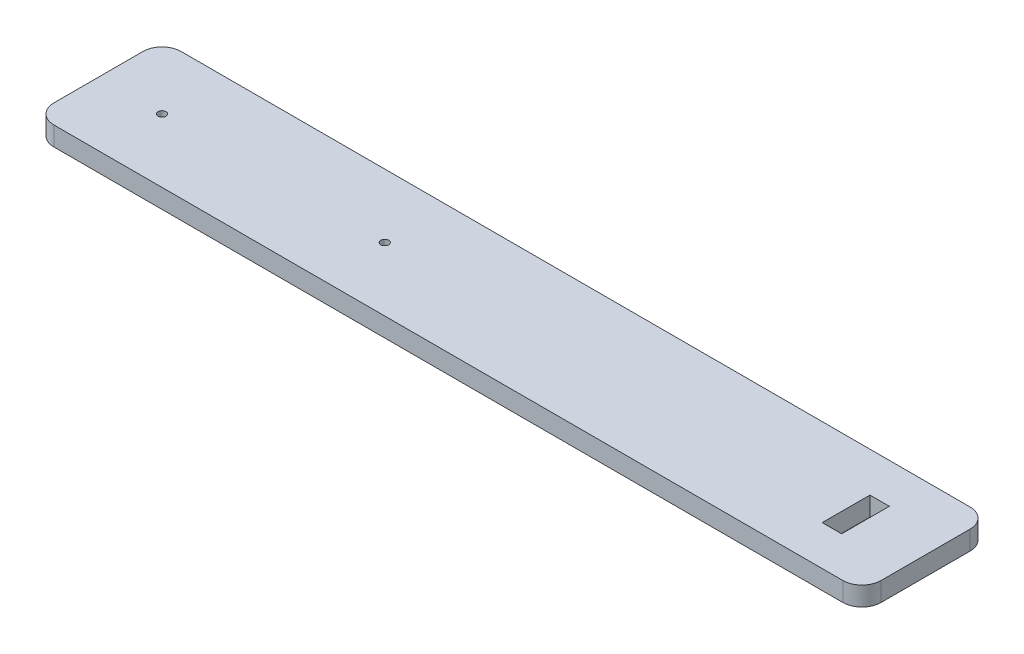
ISO-10303-21;
HEADER;
FILE_DESCRIPTION(('STEP AP214'),'2;1');
FILE_NAME('part.step','',(''),(''),'','','');
FILE_SCHEMA(('AUTOMOTIVE_DESIGN { 1 0 10303 214 1 1 1 1 }'));
ENDSEC;
DATA;
#1=APPLICATION_CONTEXT('core data for automotive mechanical design processes');
#2=APPLICATION_PROTOCOL_DEFINITION('international standard','automotive_design',2000,#1);
#3=PRODUCT_CONTEXT('',#1,'mechanical');
#4=PRODUCT('Part','Part','',(#3));
#5=PRODUCT_RELATED_PRODUCT_CATEGORY('part','',(#4));
#6=PRODUCT_DEFINITION_FORMATION('','',#4);
#7=PRODUCT_DEFINITION_CONTEXT('part definition',#1,'design');
#8=PRODUCT_DEFINITION('design','',#6,#7);
#9=PRODUCT_DEFINITION_SHAPE('','',#8);
#10=(LENGTH_UNIT() NAMED_UNIT(*) SI_UNIT(.MILLI.,.METRE.));
#11=(NAMED_UNIT(*) PLANE_ANGLE_UNIT() SI_UNIT($,.RADIAN.));
#12=(NAMED_UNIT(*) SI_UNIT($,.STERADIAN.) SOLID_ANGLE_UNIT());
#13=UNCERTAINTY_MEASURE_WITH_UNIT(LENGTH_MEASURE(1.E-05),#10,'distance_accuracy_value','');
#14=(GEOMETRIC_REPRESENTATION_CONTEXT(3) GLOBAL_UNCERTAINTY_ASSIGNED_CONTEXT((#13)) GLOBAL_UNIT_ASSIGNED_CONTEXT((#10,
#11,#12)) REPRESENTATION_CONTEXT('',''));
#15=CARTESIAN_POINT('',(0.,0.,0.));
#16=DIRECTION('',(0.,0.,1.));
#17=DIRECTION('',(1.,0.,0.));
#18=AXIS2_PLACEMENT_3D('',#15,#16,#17);
#19=CARTESIAN_POINT('',(0.,6.,0.));
#20=DIRECTION('',(0.,1.,0.));
#21=DIRECTION('',(0.,0.,1.));
#22=AXIS2_PLACEMENT_3D('',#19,#20,#21);
#23=PLANE('',#22);
#24=CARTESIAN_POINT('',(-110.,6.,0.));
#25=DIRECTION('',(0.,1.,0.));
#26=DIRECTION('',(0.,0.,1.));
#27=AXIS2_PLACEMENT_3D('',#24,#25,#26);
#28=CIRCLE('',#27,1.25);
#29=CARTESIAN_POINT('',(-110.,6.,1.25));
#30=VERTEX_POINT('',#29);
#31=EDGE_CURVE('E199',#30,#30,#28,.T.);
#32=ORIENTED_EDGE('',*,*,#31,.F.);
#33=EDGE_LOOP('',(#32));
#34=FACE_BOUND('',#33,.T.);
#35=DIRECTION('',(0.,0.,1.));
#36=VECTOR('',#35,1.);
#37=CARTESIAN_POINT('',(-130.,6.,-20.));
#38=LINE('',#37,#36);
#39=CARTESIAN_POINT('',(-130.,6.,-14.));
#40=VERTEX_POINT('',#39);
#41=CARTESIAN_POINT('',(-130.,6.,14.));
#42=VERTEX_POINT('',#41);
#43=EDGE_CURVE('E214',#40,#42,#38,.T.);
#44=ORIENTED_EDGE('',*,*,#43,.T.);
#45=CARTESIAN_POINT('',(-124.,6.,14.));
#46=DIRECTION('',(0.,1.,0.));
#47=DIRECTION('',(0.,0.,1.));
#48=AXIS2_PLACEMENT_3D('',#45,#46,#47);
#49=CIRCLE('',#48,6.);
#50=CARTESIAN_POINT('',(-124.,6.,20.));
#51=VERTEX_POINT('',#50);
#52=EDGE_CURVE('E269',#42,#51,#49,.T.);
#53=ORIENTED_EDGE('',*,*,#52,.T.);
#54=DIRECTION('',(1.,0.,0.));
#55=VECTOR('',#54,1.);
#56=CARTESIAN_POINT('',(-130.,6.,20.));
#57=LINE('',#56,#55);
#58=CARTESIAN_POINT('',(124.,6.,20.));
#59=VERTEX_POINT('',#58);
#60=EDGE_CURVE('E218',#51,#59,#57,.T.);
#61=ORIENTED_EDGE('',*,*,#60,.T.);
#62=CARTESIAN_POINT('',(124.,6.,14.));
#63=DIRECTION('',(0.,1.,0.));
#64=DIRECTION('',(0.,0.,1.));
#65=AXIS2_PLACEMENT_3D('',#62,#63,#64);
#66=CIRCLE('',#65,6.);
#67=CARTESIAN_POINT('',(130.,6.,14.));
#68=VERTEX_POINT('',#67);
#69=EDGE_CURVE('E263',#59,#68,#66,.T.);
#70=ORIENTED_EDGE('',*,*,#69,.T.);
#71=DIRECTION('',(0.,0.,-1.));
#72=VECTOR('',#71,1.);
#73=CARTESIAN_POINT('',(130.,6.,-20.));
#74=LINE('',#73,#72);
#75=CARTESIAN_POINT('',(130.,6.,-14.));
#76=VERTEX_POINT('',#75);
#77=EDGE_CURVE('E207',#68,#76,#74,.T.);
#78=ORIENTED_EDGE('',*,*,#77,.T.);
#79=CARTESIAN_POINT('',(124.,6.,-14.));
#80=DIRECTION('',(0.,1.,0.));
#81=DIRECTION('',(0.,0.,1.));
#82=AXIS2_PLACEMENT_3D('',#79,#80,#81);
#83=CIRCLE('',#82,6.);
#84=CARTESIAN_POINT('',(124.,6.,-20.));
#85=VERTEX_POINT('',#84);
#86=EDGE_CURVE('E68',#76,#85,#83,.T.);
#87=ORIENTED_EDGE('',*,*,#86,.T.);
#88=DIRECTION('',(-1.,0.,0.));
#89=VECTOR('',#88,1.);
#90=CARTESIAN_POINT('',(-130.,6.,-20.));
#91=LINE('',#90,#89);
#92=CARTESIAN_POINT('',(-124.,6.,-20.));
#93=VERTEX_POINT('',#92);
#94=EDGE_CURVE('E210',#85,#93,#91,.T.);
#95=ORIENTED_EDGE('',*,*,#94,.T.);
#96=CARTESIAN_POINT('',(-124.,6.,-14.));
#97=DIRECTION('',(0.,1.,0.));
#98=DIRECTION('',(0.,0.,1.));
#99=AXIS2_PLACEMENT_3D('',#96,#97,#98);
#100=CIRCLE('',#99,6.);
#101=EDGE_CURVE('E266',#93,#40,#100,.T.);
#102=ORIENTED_EDGE('',*,*,#101,.T.);
#103=EDGE_LOOP('',(#44,#53,#61,#70,#78,#87,#95,#102));
#104=FACE_BOUND('',#103,.T.);
#105=CARTESIAN_POINT('',(-40.,6.,0.));
#106=DIRECTION('',(0.,1.,0.));
#107=DIRECTION('',(0.,0.,1.));
#108=AXIS2_PLACEMENT_3D('',#105,#106,#107);
#109=CIRCLE('',#108,1.25);
#110=CARTESIAN_POINT('',(-40.,6.,1.25));
#111=VERTEX_POINT('',#110);
#112=EDGE_CURVE('E191',#111,#111,#109,.T.);
#113=ORIENTED_EDGE('',*,*,#112,.F.);
#114=EDGE_LOOP('',(#113));
#115=FACE_BOUND('',#114,.T.);
#116=DIRECTION('',(-1.,0.,0.));
#117=VECTOR('',#116,1.);
#118=CARTESIAN_POINT('',(105.,6.,-7.5));
#119=LINE('',#118,#117);
#120=CARTESIAN_POINT('',(111.1,6.,-7.5));
#121=VERTEX_POINT('',#120);
#122=CARTESIAN_POINT('',(105.,6.,-7.5));
#123=VERTEX_POINT('',#122);
#124=EDGE_CURVE('E149',#121,#123,#119,.T.);
#125=ORIENTED_EDGE('',*,*,#124,.F.);
#126=DIRECTION('',(0.,0.,-1.));
#127=VECTOR('',#126,1.);
#128=CARTESIAN_POINT('',(111.1,6.,-7.5));
#129=LINE('',#128,#127);
#130=CARTESIAN_POINT('',(111.1,6.,7.5));
#131=VERTEX_POINT('',#130);
#132=EDGE_CURVE('E138',#131,#121,#129,.T.);
#133=ORIENTED_EDGE('',*,*,#132,.F.);
#134=DIRECTION('',(1.,0.,0.));
#135=VECTOR('',#134,1.);
#136=CARTESIAN_POINT('',(105.,6.,7.5));
#137=LINE('',#136,#135);
#138=CARTESIAN_POINT('',(105.,6.,7.5));
#139=VERTEX_POINT('',#138);
#140=EDGE_CURVE('E167',#139,#131,#137,.T.);
#141=ORIENTED_EDGE('',*,*,#140,.F.);
#142=DIRECTION('',(0.,0.,1.));
#143=VECTOR('',#142,1.);
#144=CARTESIAN_POINT('',(105.,6.,-7.5));
#145=LINE('',#144,#143);
#146=EDGE_CURVE('E163',#123,#139,#145,.T.);
#147=ORIENTED_EDGE('',*,*,#146,.F.);
#148=EDGE_LOOP('',(#125,#133,#141,#147));
#149=FACE_BOUND('',#148,.T.);
#150=ADVANCED_FACE('F45',(#34,#104,#115,#149),#23,.T.);
#151=CARTESIAN_POINT('',(0.,0.,0.));
#152=DIRECTION('',(0.,1.,0.));
#153=DIRECTION('',(0.,0.,1.));
#154=AXIS2_PLACEMENT_3D('',#151,#152,#153);
#155=PLANE('',#154);
#156=CARTESIAN_POINT('',(-40.,0.,0.));
#157=DIRECTION('',(0.,1.,0.));
#158=DIRECTION('',(0.,0.,1.));
#159=AXIS2_PLACEMENT_3D('',#156,#157,#158);
#160=CIRCLE('',#159,1.25);
#161=CARTESIAN_POINT('',(-40.,0.,1.25));
#162=VERTEX_POINT('',#161);
#163=EDGE_CURVE('E158',#162,#162,#160,.T.);
#164=ORIENTED_EDGE('',*,*,#163,.T.);
#165=EDGE_LOOP('',(#164));
#166=FACE_BOUND('',#165,.T.);
#167=CARTESIAN_POINT('',(-110.,0.,0.));
#168=DIRECTION('',(0.,1.,0.));
#169=DIRECTION('',(0.,0.,1.));
#170=AXIS2_PLACEMENT_3D('',#167,#168,#169);
#171=CIRCLE('',#170,1.25);
#172=CARTESIAN_POINT('',(-110.,0.,1.25));
#173=VERTEX_POINT('',#172);
#174=EDGE_CURVE('E195',#173,#173,#171,.T.);
#175=ORIENTED_EDGE('',*,*,#174,.T.);
#176=EDGE_LOOP('',(#175));
#177=FACE_BOUND('',#176,.T.);
#178=DIRECTION('',(1.,0.,0.));
#179=VECTOR('',#178,1.);
#180=CARTESIAN_POINT('',(-130.,0.,20.));
#181=LINE('',#180,#179);
#182=CARTESIAN_POINT('',(-124.,0.,20.));
#183=VERTEX_POINT('',#182);
#184=CARTESIAN_POINT('',(124.,0.,20.));
#185=VERTEX_POINT('',#184);
#186=EDGE_CURVE('E211',#183,#185,#181,.T.);
#187=ORIENTED_EDGE('',*,*,#186,.F.);
#188=CARTESIAN_POINT('',(-124.,0.,14.));
#189=DIRECTION('',(0.,1.,0.));
#190=DIRECTION('',(0.,0.,1.));
#191=AXIS2_PLACEMENT_3D('',#188,#189,#190);
#192=CIRCLE('',#191,6.);
#193=CARTESIAN_POINT('',(-130.,0.,14.));
#194=VERTEX_POINT('',#193);
#195=EDGE_CURVE('E251',#183,#194,#192,.F.);
#196=ORIENTED_EDGE('',*,*,#195,.T.);
#197=DIRECTION('',(0.,0.,1.));
#198=VECTOR('',#197,1.);
#199=CARTESIAN_POINT('',(-130.,0.,-20.));
#200=LINE('',#199,#198);
#201=CARTESIAN_POINT('',(-130.,0.,-14.));
#202=VERTEX_POINT('',#201);
#203=EDGE_CURVE('E229',#202,#194,#200,.T.);
#204=ORIENTED_EDGE('',*,*,#203,.F.);
#205=CARTESIAN_POINT('',(-124.,0.,-14.));
#206=DIRECTION('',(0.,1.,0.));
#207=DIRECTION('',(0.,0.,1.));
#208=AXIS2_PLACEMENT_3D('',#205,#206,#207);
#209=CIRCLE('',#208,6.);
#210=CARTESIAN_POINT('',(-124.,0.,-20.));
#211=VERTEX_POINT('',#210);
#212=EDGE_CURVE('E248',#202,#211,#209,.F.);
#213=ORIENTED_EDGE('',*,*,#212,.T.);
#214=DIRECTION('',(-1.,0.,0.));
#215=VECTOR('',#214,1.);
#216=CARTESIAN_POINT('',(-130.,0.,-20.));
#217=LINE('',#216,#215);
#218=CARTESIAN_POINT('',(124.,0.,-20.));
#219=VERTEX_POINT('',#218);
#220=EDGE_CURVE('E226',#219,#211,#217,.T.);
#221=ORIENTED_EDGE('',*,*,#220,.F.);
#222=CARTESIAN_POINT('',(124.,0.,-14.));
#223=DIRECTION('',(0.,1.,0.));
#224=DIRECTION('',(0.,0.,1.));
#225=AXIS2_PLACEMENT_3D('',#222,#223,#224);
#226=CIRCLE('',#225,6.);
#227=CARTESIAN_POINT('',(130.,0.,-14.));
#228=VERTEX_POINT('',#227);
#229=EDGE_CURVE('E242',#219,#228,#226,.F.);
#230=ORIENTED_EDGE('',*,*,#229,.T.);
#231=DIRECTION('',(0.,0.,-1.));
#232=VECTOR('',#231,1.);
#233=CARTESIAN_POINT('',(130.,0.,-20.));
#234=LINE('',#233,#232);
#235=CARTESIAN_POINT('',(130.,0.,14.));
#236=VERTEX_POINT('',#235);
#237=EDGE_CURVE('E203',#236,#228,#234,.T.);
#238=ORIENTED_EDGE('',*,*,#237,.F.);
#239=CARTESIAN_POINT('',(124.,0.,14.));
#240=DIRECTION('',(0.,1.,0.));
#241=DIRECTION('',(0.,0.,1.));
#242=AXIS2_PLACEMENT_3D('',#239,#240,#241);
#243=CIRCLE('',#242,6.);
#244=EDGE_CURVE('E245',#236,#185,#243,.F.);
#245=ORIENTED_EDGE('',*,*,#244,.T.);
#246=EDGE_LOOP('',(#187,#196,#204,#213,#221,#230,#238,#245));
#247=FACE_BOUND('',#246,.T.);
#248=DIRECTION('',(0.,0.,-1.));
#249=VECTOR('',#248,1.);
#250=CARTESIAN_POINT('',(111.1,0.,-7.5));
#251=LINE('',#250,#249);
#252=CARTESIAN_POINT('',(111.1,0.,7.5));
#253=VERTEX_POINT('',#252);
#254=CARTESIAN_POINT('',(111.1,0.,-7.5));
#255=VERTEX_POINT('',#254);
#256=EDGE_CURVE('E172',#253,#255,#251,.T.);
#257=ORIENTED_EDGE('',*,*,#256,.T.);
#258=DIRECTION('',(-1.,0.,0.));
#259=VECTOR('',#258,1.);
#260=CARTESIAN_POINT('',(105.,0.,-7.5));
#261=LINE('',#260,#259);
#262=CARTESIAN_POINT('',(105.,0.,-7.5));
#263=VERTEX_POINT('',#262);
#264=EDGE_CURVE('E156',#255,#263,#261,.T.);
#265=ORIENTED_EDGE('',*,*,#264,.T.);
#266=DIRECTION('',(0.,0.,1.));
#267=VECTOR('',#266,1.);
#268=CARTESIAN_POINT('',(105.,0.,-7.5));
#269=LINE('',#268,#267);
#270=CARTESIAN_POINT('',(105.,0.,7.5));
#271=VERTEX_POINT('',#270);
#272=EDGE_CURVE('E177',#263,#271,#269,.T.);
#273=ORIENTED_EDGE('',*,*,#272,.T.);
#274=DIRECTION('',(1.,0.,0.));
#275=VECTOR('',#274,1.);
#276=CARTESIAN_POINT('',(105.,0.,7.5));
#277=LINE('',#276,#275);
#278=EDGE_CURVE('E150',#271,#253,#277,.T.);
#279=ORIENTED_EDGE('',*,*,#278,.T.);
#280=EDGE_LOOP('',(#257,#265,#273,#279));
#281=FACE_BOUND('',#280,.T.);
#282=ADVANCED_FACE('F292',(#166,#177,#247,#281),#155,.F.);
#283=CARTESIAN_POINT('',(130.,6.,-20.));
#284=DIRECTION('',(-1.,0.,0.));
#285=DIRECTION('',(0.,0.,1.));
#286=AXIS2_PLACEMENT_3D('',#283,#284,#285);
#287=PLANE('',#286);
#288=ORIENTED_EDGE('',*,*,#77,.F.);
#289=DIRECTION('',(0.,-1.,0.));
#290=VECTOR('',#289,1.);
#291=CARTESIAN_POINT('',(130.,6.,14.));
#292=LINE('',#291,#290);
#293=EDGE_CURVE('E11',#68,#236,#292,.T.);
#294=ORIENTED_EDGE('',*,*,#293,.T.);
#295=ORIENTED_EDGE('',*,*,#237,.T.);
#296=DIRECTION('',(0.,-1.,0.));
#297=VECTOR('',#296,1.);
#298=CARTESIAN_POINT('',(130.,6.,-14.));
#299=LINE('',#298,#297);
#300=EDGE_CURVE('E54',#228,#76,#299,.F.);
#301=ORIENTED_EDGE('',*,*,#300,.T.);
#302=EDGE_LOOP('',(#288,#294,#295,#301));
#303=FACE_BOUND('',#302,.T.);
#304=ADVANCED_FACE('F281',(#303),#287,.F.);
#305=CARTESIAN_POINT('',(-130.,6.,-20.));
#306=DIRECTION('',(0.,0.,1.));
#307=DIRECTION('',(1.,0.,0.));
#308=AXIS2_PLACEMENT_3D('',#305,#306,#307);
#309=PLANE('',#308);
#310=ORIENTED_EDGE('',*,*,#220,.T.);
#311=DIRECTION('',(0.,-1.,0.));
#312=VECTOR('',#311,1.);
#313=CARTESIAN_POINT('',(-124.,6.,-20.));
#314=LINE('',#313,#312);
#315=EDGE_CURVE('E61',#211,#93,#314,.F.);
#316=ORIENTED_EDGE('',*,*,#315,.T.);
#317=ORIENTED_EDGE('',*,*,#94,.F.);
#318=DIRECTION('',(0.,-1.,0.));
#319=VECTOR('',#318,1.);
#320=CARTESIAN_POINT('',(124.,6.,-20.));
#321=LINE('',#320,#319);
#322=EDGE_CURVE('E272',#85,#219,#321,.T.);
#323=ORIENTED_EDGE('',*,*,#322,.T.);
#324=EDGE_LOOP('',(#310,#316,#317,#323));
#325=FACE_BOUND('',#324,.T.);
#326=ADVANCED_FACE('F289',(#325),#309,.F.);
#327=CARTESIAN_POINT('',(-130.,6.,-20.));
#328=DIRECTION('',(1.,0.,0.));
#329=DIRECTION('',(0.,0.,-1.));
#330=AXIS2_PLACEMENT_3D('',#327,#328,#329);
#331=PLANE('',#330);
#332=ORIENTED_EDGE('',*,*,#203,.T.);
#333=DIRECTION('',(0.,-1.,0.));
#334=VECTOR('',#333,1.);
#335=CARTESIAN_POINT('',(-130.,6.,14.));
#336=LINE('',#335,#334);
#337=EDGE_CURVE('E258',#194,#42,#336,.F.);
#338=ORIENTED_EDGE('',*,*,#337,.T.);
#339=ORIENTED_EDGE('',*,*,#43,.F.);
#340=DIRECTION('',(0.,-1.,0.));
#341=VECTOR('',#340,1.);
#342=CARTESIAN_POINT('',(-130.,6.,-14.));
#343=LINE('',#342,#341);
#344=EDGE_CURVE('E254',#40,#202,#343,.T.);
#345=ORIENTED_EDGE('',*,*,#344,.T.);
#346=EDGE_LOOP('',(#332,#338,#339,#345));
#347=FACE_BOUND('',#346,.T.);
#348=ADVANCED_FACE('F301',(#347),#331,.F.);
#349=CARTESIAN_POINT('',(-130.,6.,20.));
#350=DIRECTION('',(0.,0.,-1.));
#351=DIRECTION('',(-1.,0.,0.));
#352=AXIS2_PLACEMENT_3D('',#349,#350,#351);
#353=PLANE('',#352);
#354=ORIENTED_EDGE('',*,*,#60,.F.);
#355=DIRECTION('',(0.,-1.,0.));
#356=VECTOR('',#355,1.);
#357=CARTESIAN_POINT('',(-124.,6.,20.));
#358=LINE('',#357,#356);
#359=EDGE_CURVE('E238',#51,#183,#358,.T.);
#360=ORIENTED_EDGE('',*,*,#359,.T.);
#361=ORIENTED_EDGE('',*,*,#186,.T.);
#362=DIRECTION('',(0.,-1.,0.));
#363=VECTOR('',#362,1.);
#364=CARTESIAN_POINT('',(124.,6.,20.));
#365=LINE('',#364,#363);
#366=EDGE_CURVE('E222',#185,#59,#365,.F.);
#367=ORIENTED_EDGE('',*,*,#366,.T.);
#368=EDGE_LOOP('',(#354,#360,#361,#367));
#369=FACE_BOUND('',#368,.T.);
#370=ADVANCED_FACE('F309',(#369),#353,.F.);
#371=CARTESIAN_POINT('',(-110.,6.,0.));
#372=DIRECTION('',(0.,-1.,0.));
#373=DIRECTION('',(0.,0.,-1.));
#374=AXIS2_PLACEMENT_3D('',#371,#372,#373);
#375=CYLINDRICAL_SURFACE('',#374,1.25);
#376=ORIENTED_EDGE('',*,*,#31,.T.);
#377=EDGE_LOOP('',(#376));
#378=FACE_BOUND('',#377,.T.);
#379=ORIENTED_EDGE('',*,*,#174,.F.);
#380=EDGE_LOOP('',(#379));
#381=FACE_BOUND('',#380,.T.);
#382=ADVANCED_FACE('F330',(#378,#381),#375,.F.);
#383=CARTESIAN_POINT('',(-40.,6.,0.));
#384=DIRECTION('',(0.,-1.,0.));
#385=DIRECTION('',(0.,0.,-1.));
#386=AXIS2_PLACEMENT_3D('',#383,#384,#385);
#387=CYLINDRICAL_SURFACE('',#386,1.25);
#388=ORIENTED_EDGE('',*,*,#112,.T.);
#389=EDGE_LOOP('',(#388));
#390=FACE_BOUND('',#389,.T.);
#391=ORIENTED_EDGE('',*,*,#163,.F.);
#392=EDGE_LOOP('',(#391));
#393=FACE_BOUND('',#392,.T.);
#394=ADVANCED_FACE('F358',(#390,#393),#387,.F.);
#395=CARTESIAN_POINT('',(111.1,6.,-7.5));
#396=DIRECTION('',(-1.,0.,0.));
#397=DIRECTION('',(0.,0.,1.));
#398=AXIS2_PLACEMENT_3D('',#395,#396,#397);
#399=PLANE('',#398);
#400=ORIENTED_EDGE('',*,*,#256,.F.);
#401=DIRECTION('',(0.,-1.,0.));
#402=VECTOR('',#401,1.);
#403=CARTESIAN_POINT('',(111.1,6.,7.5));
#404=LINE('',#403,#402);
#405=EDGE_CURVE('E144',#131,#253,#404,.T.);
#406=ORIENTED_EDGE('',*,*,#405,.F.);
#407=ORIENTED_EDGE('',*,*,#132,.T.);
#408=DIRECTION('',(0.,-1.,0.));
#409=VECTOR('',#408,1.);
#410=CARTESIAN_POINT('',(111.1,6.,-7.5));
#411=LINE('',#410,#409);
#412=EDGE_CURVE('E141',#121,#255,#411,.T.);
#413=ORIENTED_EDGE('',*,*,#412,.T.);
#414=EDGE_LOOP('',(#400,#406,#407,#413));
#415=FACE_BOUND('',#414,.T.);
#416=ADVANCED_FACE('F140',(#415),#399,.T.);
#417=CARTESIAN_POINT('',(105.,6.,-7.5));
#418=DIRECTION('',(0.,0.,1.));
#419=DIRECTION('',(1.,0.,0.));
#420=AXIS2_PLACEMENT_3D('',#417,#418,#419);
#421=PLANE('',#420);
#422=ORIENTED_EDGE('',*,*,#264,.F.);
#423=ORIENTED_EDGE('',*,*,#412,.F.);
#424=ORIENTED_EDGE('',*,*,#124,.T.);
#425=DIRECTION('',(0.,-1.,0.));
#426=VECTOR('',#425,1.);
#427=CARTESIAN_POINT('',(105.,6.,-7.5));
#428=LINE('',#427,#426);
#429=EDGE_CURVE('E159',#123,#263,#428,.T.);
#430=ORIENTED_EDGE('',*,*,#429,.T.);
#431=EDGE_LOOP('',(#422,#423,#424,#430));
#432=FACE_BOUND('',#431,.T.);
#433=ADVANCED_FACE('F153',(#432),#421,.T.);
#434=CARTESIAN_POINT('',(105.,6.,-7.5));
#435=DIRECTION('',(1.,0.,0.));
#436=DIRECTION('',(0.,0.,-1.));
#437=AXIS2_PLACEMENT_3D('',#434,#435,#436);
#438=PLANE('',#437);
#439=ORIENTED_EDGE('',*,*,#272,.F.);
#440=ORIENTED_EDGE('',*,*,#429,.F.);
#441=ORIENTED_EDGE('',*,*,#146,.T.);
#442=DIRECTION('',(0.,-1.,0.));
#443=VECTOR('',#442,1.);
#444=CARTESIAN_POINT('',(105.,6.,7.5));
#445=LINE('',#444,#443);
#446=EDGE_CURVE('E186',#139,#271,#445,.T.);
#447=ORIENTED_EDGE('',*,*,#446,.T.);
#448=EDGE_LOOP('',(#439,#440,#441,#447));
#449=FACE_BOUND('',#448,.T.);
#450=ADVANCED_FACE('F345',(#449),#438,.T.);
#451=CARTESIAN_POINT('',(105.,6.,7.5));
#452=DIRECTION('',(0.,0.,-1.));
#453=DIRECTION('',(-1.,0.,0.));
#454=AXIS2_PLACEMENT_3D('',#451,#452,#453);
#455=PLANE('',#454);
#456=ORIENTED_EDGE('',*,*,#278,.F.);
#457=ORIENTED_EDGE('',*,*,#446,.F.);
#458=ORIENTED_EDGE('',*,*,#140,.T.);
#459=ORIENTED_EDGE('',*,*,#405,.T.);
#460=EDGE_LOOP('',(#456,#457,#458,#459));
#461=FACE_BOUND('',#460,.T.);
#462=ADVANCED_FACE('F342',(#461),#455,.T.);
#463=CARTESIAN_POINT('',(-124.,6.,14.));
#464=DIRECTION('',(0.,-1.,0.));
#465=DIRECTION('',(0.,0.,-1.));
#466=AXIS2_PLACEMENT_3D('',#463,#464,#465);
#467=CYLINDRICAL_SURFACE('',#466,6.);
#468=ORIENTED_EDGE('',*,*,#52,.F.);
#469=ORIENTED_EDGE('',*,*,#337,.F.);
#470=ORIENTED_EDGE('',*,*,#195,.F.);
#471=ORIENTED_EDGE('',*,*,#359,.F.);
#472=EDGE_LOOP('',(#468,#469,#470,#471));
#473=FACE_BOUND('',#472,.T.);
#474=ADVANCED_FACE('F307',(#473),#467,.T.);
#475=CARTESIAN_POINT('',(-124.,6.,-14.));
#476=DIRECTION('',(0.,-1.,0.));
#477=DIRECTION('',(0.,0.,-1.));
#478=AXIS2_PLACEMENT_3D('',#475,#476,#477);
#479=CYLINDRICAL_SURFACE('',#478,6.);
#480=ORIENTED_EDGE('',*,*,#101,.F.);
#481=ORIENTED_EDGE('',*,*,#315,.F.);
#482=ORIENTED_EDGE('',*,*,#212,.F.);
#483=ORIENTED_EDGE('',*,*,#344,.F.);
#484=EDGE_LOOP('',(#480,#481,#482,#483));
#485=FACE_BOUND('',#484,.T.);
#486=ADVANCED_FACE('F298',(#485),#479,.T.);
#487=CARTESIAN_POINT('',(124.,6.,14.));
#488=DIRECTION('',(0.,-1.,0.));
#489=DIRECTION('',(0.,0.,-1.));
#490=AXIS2_PLACEMENT_3D('',#487,#488,#489);
#491=CYLINDRICAL_SURFACE('',#490,6.);
#492=ORIENTED_EDGE('',*,*,#69,.F.);
#493=ORIENTED_EDGE('',*,*,#366,.F.);
#494=ORIENTED_EDGE('',*,*,#244,.F.);
#495=ORIENTED_EDGE('',*,*,#293,.F.);
#496=EDGE_LOOP('',(#492,#493,#494,#495));
#497=FACE_BOUND('',#496,.T.);
#498=ADVANCED_FACE('F312',(#497),#491,.T.);
#499=CARTESIAN_POINT('',(124.,6.,-14.));
#500=DIRECTION('',(0.,-1.,0.));
#501=DIRECTION('',(0.,0.,-1.));
#502=AXIS2_PLACEMENT_3D('',#499,#500,#501);
#503=CYLINDRICAL_SURFACE('',#502,6.);
#504=ORIENTED_EDGE('',*,*,#86,.F.);
#505=ORIENTED_EDGE('',*,*,#300,.F.);
#506=ORIENTED_EDGE('',*,*,#229,.F.);
#507=ORIENTED_EDGE('',*,*,#322,.F.);
#508=EDGE_LOOP('',(#504,#505,#506,#507));
#509=FACE_BOUND('',#508,.T.);
#510=ADVANCED_FACE('F47',(#509),#503,.T.);
#511=CLOSED_SHELL('',(#150,#282,#304,#326,#348,#370,#382,#394,#416,#433,#450,#462,#474,#486,
#498,#510));
#512=MANIFOLD_SOLID_BREP('B2',#511);
#513=ADVANCED_BREP_SHAPE_REPRESENTATION('',(#18,#512),#14);
#514=SHAPE_DEFINITION_REPRESENTATION(#9,#513);
ENDSEC;
END-ISO-10303-21;
